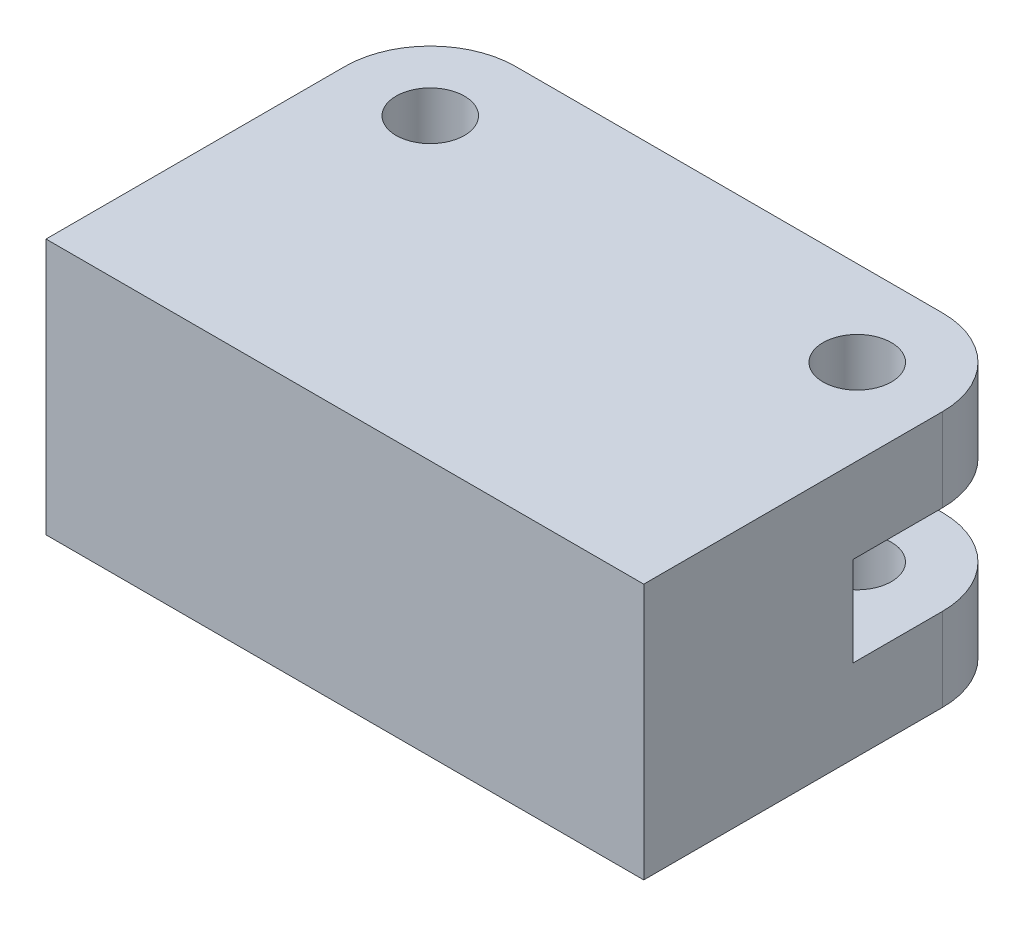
from build123d import *

# Parameters (mm, degrees)
SKETCH_1_W          = 28
SKETCH_1_H          = 18
SKETCH_1_R          = 1.6
EXTRUDE_1_DEPTH     = 12
SKETCH_2_W          = 28
SKETCH_2_H          = 4.2
CUT_EXTRUDE_1_DEPTH = 8.2
FILLET_1_R          = 4


with BuildPart() as part:
    # Sketch 1 → Extrude 1 (new body)
    with BuildSketch(Plane(origin=(0, 0, 0), x_dir=(1, 0, 0), z_dir=(0, 1, 0))):
        with Locations((14, -9)):
            Rectangle(SKETCH_1_W, SKETCH_1_H)
        with Locations(Location((4, -4, 0), (0, 0, 270))):
            Circle(SKETCH_1_R, mode=Mode.SUBTRACT)
        with Locations(Location((24, -4, 0), (0, 0, 270))):
            Circle(SKETCH_1_R, mode=Mode.SUBTRACT)
    extrude(amount=EXTRUDE_1_DEPTH)

    # Sketch 2 → Cut-Extrude 1 (cut)
    with BuildSketch(Plane(origin=(0, 0, 0), x_dir=(-1, 0, 0), z_dir=(0, 0, -1))):
        with Locations((-14, 6)):
            Rectangle(SKETCH_2_W, SKETCH_2_H)
    extrude(amount=-CUT_EXTRUDE_1_DEPTH, mode=Mode.SUBTRACT)

    # Fillet 1
    fillet_1_edges = [part.edges().sort_by_distance(p)[0] for p in [
        (0, 1.95, 0),
        (28, 1.95, 0),
        (0, 10.05, 0),
        (28, 10.05, 0),
    ]]
    fillet(fillet_1_edges, radius=FILLET_1_R)


solid = part.part
